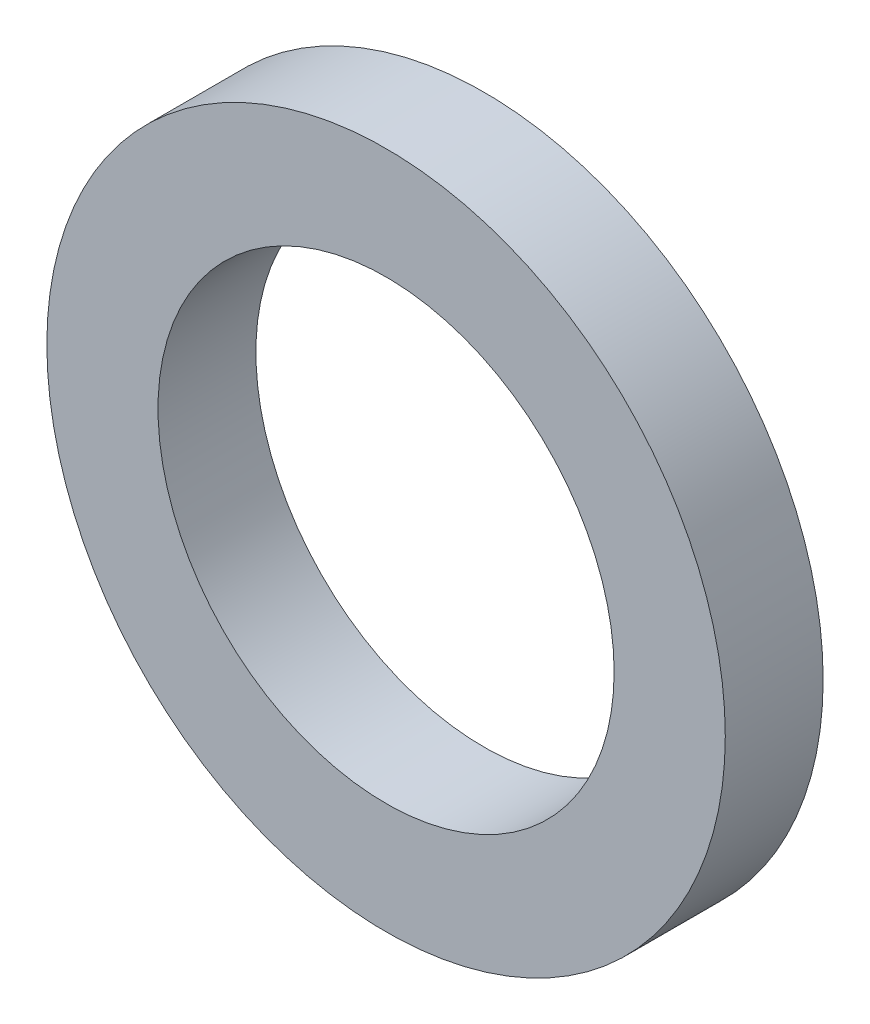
ISO-10303-21;
HEADER;
FILE_DESCRIPTION(('STEP AP214'),'2;1');
FILE_NAME('part.step','',(''),(''),'','','');
FILE_SCHEMA(('AUTOMOTIVE_DESIGN { 1 0 10303 214 1 1 1 1 }'));
ENDSEC;
DATA;
#1=APPLICATION_CONTEXT('core data for automotive mechanical design processes');
#2=APPLICATION_PROTOCOL_DEFINITION('international standard','automotive_design',2000,#1);
#3=PRODUCT_CONTEXT('',#1,'mechanical');
#4=PRODUCT('Part','Part','',(#3));
#5=PRODUCT_RELATED_PRODUCT_CATEGORY('part','',(#4));
#6=PRODUCT_DEFINITION_FORMATION('','',#4);
#7=PRODUCT_DEFINITION_CONTEXT('part definition',#1,'design');
#8=PRODUCT_DEFINITION('design','',#6,#7);
#9=PRODUCT_DEFINITION_SHAPE('','',#8);
#10=(LENGTH_UNIT() NAMED_UNIT(*) SI_UNIT(.MILLI.,.METRE.));
#11=(NAMED_UNIT(*) PLANE_ANGLE_UNIT() SI_UNIT($,.RADIAN.));
#12=(NAMED_UNIT(*) SI_UNIT($,.STERADIAN.) SOLID_ANGLE_UNIT());
#13=UNCERTAINTY_MEASURE_WITH_UNIT(LENGTH_MEASURE(1.E-05),#10,'distance_accuracy_value','');
#14=(GEOMETRIC_REPRESENTATION_CONTEXT(3) GLOBAL_UNCERTAINTY_ASSIGNED_CONTEXT((#13)) GLOBAL_UNIT_ASSIGNED_CONTEXT((#10,
#11,#12)) REPRESENTATION_CONTEXT('',''));
#15=CARTESIAN_POINT('',(0.,0.,0.));
#16=DIRECTION('',(0.,0.,1.));
#17=DIRECTION('',(1.,0.,0.));
#18=AXIS2_PLACEMENT_3D('',#15,#16,#17);
#19=CARTESIAN_POINT('',(0.,0.,1.190625));
#20=DIRECTION('',(0.,0.,-1.));
#21=DIRECTION('',(-1.,0.,0.));
#22=AXIS2_PLACEMENT_3D('',#19,#20,#21);
#23=CYLINDRICAL_SURFACE('',#22,8.255);
#24=CARTESIAN_POINT('',(0.,0.,1.190625));
#25=DIRECTION('',(0.,0.,1.));
#26=DIRECTION('',(1.,0.,0.));
#27=AXIS2_PLACEMENT_3D('',#24,#25,#26);
#28=CIRCLE('',#27,8.255);
#29=CARTESIAN_POINT('',(-8.255,0.,1.190625));
#30=VERTEX_POINT('',#29);
#31=EDGE_CURVE('E10',#30,#30,#28,.T.);
#32=CARTESIAN_POINT('',(0.,0.,-1.190625));
#33=DIRECTION('',(0.,0.,1.));
#34=DIRECTION('',(1.,0.,0.));
#35=AXIS2_PLACEMENT_3D('',#32,#33,#34);
#36=CIRCLE('',#35,8.255);
#37=CARTESIAN_POINT('',(-8.255,0.,-1.190625));
#38=VERTEX_POINT('',#37);
#39=EDGE_CURVE('E35',#38,#38,#36,.T.);
#40=CARTESIAN_POINT('',(-8.255,0.,1.190625));
#41=CARTESIAN_POINT('',(-8.255,0.,1.1658203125));
#42=CARTESIAN_POINT('',(-8.255,0.,1.141015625));
#43=CARTESIAN_POINT('',(-8.255,0.,1.09140625));
#44=CARTESIAN_POINT('',(-8.255,0.,1.0666015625));
#45=CARTESIAN_POINT('',(-8.255,0.,1.0169921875));
#46=CARTESIAN_POINT('',(-8.255,0.,0.9921875));
#47=CARTESIAN_POINT('',(-8.255,0.,0.942578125));
#48=CARTESIAN_POINT('',(-8.255,0.,0.9177734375));
#49=CARTESIAN_POINT('',(-8.255,0.,0.8681640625));
#50=CARTESIAN_POINT('',(-8.255,0.,0.843359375));
#51=CARTESIAN_POINT('',(-8.255,0.,0.79375));
#52=CARTESIAN_POINT('',(-8.255,0.,0.7689453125));
#53=CARTESIAN_POINT('',(-8.255,0.,0.7193359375));
#54=CARTESIAN_POINT('',(-8.255,0.,0.69453125));
#55=CARTESIAN_POINT('',(-8.255,0.,0.644921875));
#56=CARTESIAN_POINT('',(-8.255,0.,0.6201171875));
#57=CARTESIAN_POINT('',(-8.255,0.,0.5705078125));
#58=CARTESIAN_POINT('',(-8.255,0.,0.545703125));
#59=CARTESIAN_POINT('',(-8.255,0.,0.49609375));
#60=CARTESIAN_POINT('',(-8.255,0.,0.4712890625));
#61=CARTESIAN_POINT('',(-8.255,0.,0.4216796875));
#62=CARTESIAN_POINT('',(-8.255,0.,0.396875));
#63=CARTESIAN_POINT('',(-8.255,0.,0.347265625));
#64=CARTESIAN_POINT('',(-8.255,0.,0.3224609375));
#65=CARTESIAN_POINT('',(-8.255,0.,0.2728515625));
#66=CARTESIAN_POINT('',(-8.255,0.,0.248046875));
#67=CARTESIAN_POINT('',(-8.255,0.,0.1984375));
#68=CARTESIAN_POINT('',(-8.255,0.,0.1736328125));
#69=CARTESIAN_POINT('',(-8.255,0.,0.1240234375));
#70=CARTESIAN_POINT('',(-8.255,0.,0.0992187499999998));
#71=CARTESIAN_POINT('',(-8.255,0.,0.0496093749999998));
#72=CARTESIAN_POINT('',(-8.255,0.,0.0248046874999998));
#73=CARTESIAN_POINT('',(-8.255,0.,-0.0248046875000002));
#74=CARTESIAN_POINT('',(-8.255,0.,-0.0496093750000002));
#75=CARTESIAN_POINT('',(-8.255,0.,-0.0992187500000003));
#76=CARTESIAN_POINT('',(-8.255,0.,-0.1240234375));
#77=CARTESIAN_POINT('',(-8.255,0.,-0.1736328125));
#78=CARTESIAN_POINT('',(-8.255,0.,-0.1984375));
#79=CARTESIAN_POINT('',(-8.255,0.,-0.248046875));
#80=CARTESIAN_POINT('',(-8.255,0.,-0.2728515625));
#81=CARTESIAN_POINT('',(-8.255,0.,-0.3224609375));
#82=CARTESIAN_POINT('',(-8.255,0.,-0.347265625));
#83=CARTESIAN_POINT('',(-8.255,0.,-0.396875));
#84=CARTESIAN_POINT('',(-8.255,0.,-0.4216796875));
#85=CARTESIAN_POINT('',(-8.255,0.,-0.4712890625));
#86=CARTESIAN_POINT('',(-8.255,0.,-0.49609375));
#87=CARTESIAN_POINT('',(-8.255,0.,-0.545703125));
#88=CARTESIAN_POINT('',(-8.255,0.,-0.5705078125));
#89=CARTESIAN_POINT('',(-8.255,0.,-0.6201171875));
#90=CARTESIAN_POINT('',(-8.255,0.,-0.644921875));
#91=CARTESIAN_POINT('',(-8.255,0.,-0.69453125));
#92=CARTESIAN_POINT('',(-8.255,0.,-0.7193359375));
#93=CARTESIAN_POINT('',(-8.255,0.,-0.7689453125));
#94=CARTESIAN_POINT('',(-8.255,0.,-0.79375));
#95=CARTESIAN_POINT('',(-8.255,0.,-0.843359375));
#96=CARTESIAN_POINT('',(-8.255,0.,-0.8681640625));
#97=CARTESIAN_POINT('',(-8.255,0.,-0.9177734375));
#98=CARTESIAN_POINT('',(-8.255,0.,-0.942578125));
#99=CARTESIAN_POINT('',(-8.255,0.,-0.9921875));
#100=CARTESIAN_POINT('',(-8.255,0.,-1.0169921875));
#101=CARTESIAN_POINT('',(-8.255,0.,-1.0666015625));
#102=CARTESIAN_POINT('',(-8.255,0.,-1.09140625));
#103=CARTESIAN_POINT('',(-8.255,0.,-1.141015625));
#104=CARTESIAN_POINT('',(-8.255,0.,-1.1658203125));
#105=CARTESIAN_POINT('',(-8.255,0.,-1.190625));
#106=B_SPLINE_CURVE_WITH_KNOTS('',3,(#40,#41,#42,#43,#44,#45,#46,#47,#48,#49,#50,#51,#52,#53,
#54,#55,#56,#57,#58,#59,#60,#61,#62,#63,#64,#65,#66,#67,#68,#69,#70,#71,#72,#73,#74,#75,#76,#77,
#78,#79,#80,#81,#82,#83,#84,#85,#86,#87,#88,#89,#90,#91,#92,#93,#94,#95,#96,#97,#98,#99,#100,
#101,#102,#103,#104,#105),.UNSPECIFIED.,.F.,.F.,(4,2,2,2,2,2,2,2,2,2,2,2,2,2,2,2,2,2,2,2,2,2,2,
2,2,2,2,2,2,2,2,2,4),(0.,0.0744140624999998,0.148828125,0.2232421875,0.29765625,0.3720703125,
0.446484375,0.5208984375,0.5953125,0.6697265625,0.744140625,0.8185546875,0.89296875,
0.9673828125,1.041796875,1.1162109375,1.190625,1.2650390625,1.339453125,1.4138671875,1.48828125,
1.5626953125,1.637109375,1.7115234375,1.7859375,1.8603515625,1.934765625,2.0091796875,
2.08359375,2.1580078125,2.232421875,2.3068359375,2.38125),.UNSPECIFIED.);
#107=EDGE_CURVE('BSEAM29',#30,#38,#106,.T.);
#108=ORIENTED_EDGE('',*,*,#31,.F.);
#109=ORIENTED_EDGE('',*,*,#39,.T.);
#110=ORIENTED_EDGE('',*,*,#107,.T.);
#111=ORIENTED_EDGE('',*,*,#107,.F.);
#112=EDGE_LOOP('',(#108,#110,#109,#111));
#113=FACE_BOUND('',#112,.T.);
#114=ADVANCED_FACE('F29',(#113),#23,.T.);
#115=CARTESIAN_POINT('',(0.,0.,1.190625));
#116=DIRECTION('',(0.,0.,1.));
#117=DIRECTION('',(1.,0.,0.));
#118=AXIS2_PLACEMENT_3D('',#115,#116,#117);
#119=PLANE('',#118);
#120=CARTESIAN_POINT('',(0.,0.,1.190625));
#121=DIRECTION('',(0.,0.,1.));
#122=DIRECTION('',(1.,0.,0.));
#123=AXIS2_PLACEMENT_3D('',#120,#121,#122);
#124=CIRCLE('',#123,5.54990000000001);
#125=CARTESIAN_POINT('',(5.54990000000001,0.,1.190625));
#126=VERTEX_POINT('',#125);
#127=EDGE_CURVE('E43',#126,#126,#124,.T.);
#128=ORIENTED_EDGE('',*,*,#127,.F.);
#129=EDGE_LOOP('',(#128));
#130=FACE_BOUND('',#129,.T.);
#131=ORIENTED_EDGE('',*,*,#31,.T.);
#132=EDGE_LOOP('',(#131));
#133=FACE_BOUND('',#132,.T.);
#134=ADVANCED_FACE('F51',(#130,#133),#119,.T.);
#135=CARTESIAN_POINT('',(0.,0.,-1.190625));
#136=DIRECTION('',(0.,0.,1.));
#137=DIRECTION('',(1.,0.,0.));
#138=AXIS2_PLACEMENT_3D('',#135,#136,#137);
#139=PLANE('',#138);
#140=CARTESIAN_POINT('',(0.,0.,-1.190625));
#141=DIRECTION('',(0.,0.,1.));
#142=DIRECTION('',(1.,0.,0.));
#143=AXIS2_PLACEMENT_3D('',#140,#141,#142);
#144=CIRCLE('',#143,5.54990000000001);
#145=CARTESIAN_POINT('',(5.54990000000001,0.,-1.190625));
#146=VERTEX_POINT('',#145);
#147=EDGE_CURVE('E39',#146,#146,#144,.T.);
#148=ORIENTED_EDGE('',*,*,#147,.T.);
#149=EDGE_LOOP('',(#148));
#150=FACE_BOUND('',#149,.T.);
#151=ORIENTED_EDGE('',*,*,#39,.F.);
#152=EDGE_LOOP('',(#151));
#153=FACE_BOUND('',#152,.T.);
#154=ADVANCED_FACE('F53',(#150,#153),#139,.F.);
#155=CARTESIAN_POINT('',(0.,0.,1.190625));
#156=DIRECTION('',(0.,0.,1.));
#157=DIRECTION('',(1.,0.,0.));
#158=AXIS2_PLACEMENT_3D('',#155,#156,#157);
#159=CYLINDRICAL_SURFACE('',#158,5.54990000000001);
#160=ORIENTED_EDGE('',*,*,#147,.F.);
#161=EDGE_LOOP('',(#160));
#162=FACE_BOUND('',#161,.T.);
#163=ORIENTED_EDGE('',*,*,#127,.T.);
#164=EDGE_LOOP('',(#163));
#165=FACE_BOUND('',#164,.T.);
#166=ADVANCED_FACE('F49',(#162,#165),#159,.F.);
#167=CLOSED_SHELL('',(#114,#134,#154,#166));
#168=MANIFOLD_SOLID_BREP('B2',#167);
#169=ADVANCED_BREP_SHAPE_REPRESENTATION('',(#18,#168),#14);
#170=SHAPE_DEFINITION_REPRESENTATION(#9,#169);
ENDSEC;
END-ISO-10303-21;
